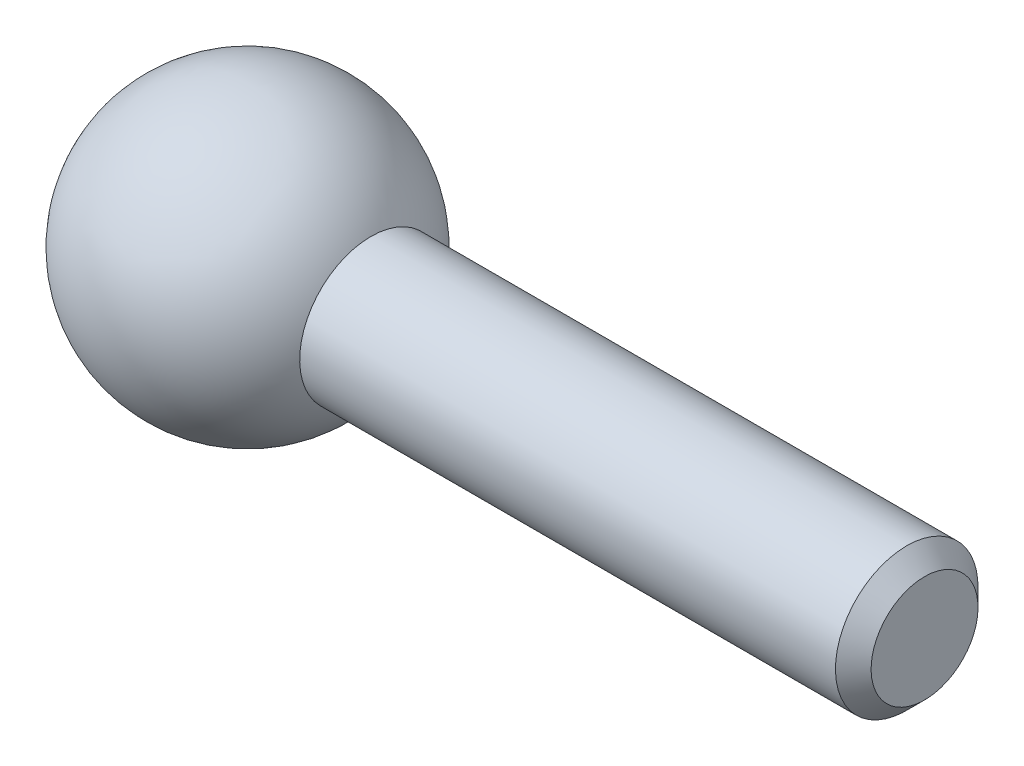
from build123d import *

# Parameters (mm, degrees)
CHANFREIN1_SIZE = 0.5


with BuildPart() as part:
    # Esquisse1 → Base-R_volution (revolve)
    with BuildSketch(Plane.XY):
        with BuildLine():
            Line((19, 0), (-4, 0))
            ThreePointArc((-4, 0), (-1.03527618, 3.863703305), (3.464101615, 2))
            Line((3.464101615, 2), (19, 2))
            Line((19, 2), (19, 0))
        make_face()
    revolve(axis=Axis((0, 0, 0), (-1, 0, 0)))

    # Chanfrein1
    chanfrein1_edges = [part.edges().sort_by_distance(p)[0] for p in [
        (19, -2, 0),
    ]]
    chamfer(chanfrein1_edges, length=CHANFREIN1_SIZE)


solid = part.part
